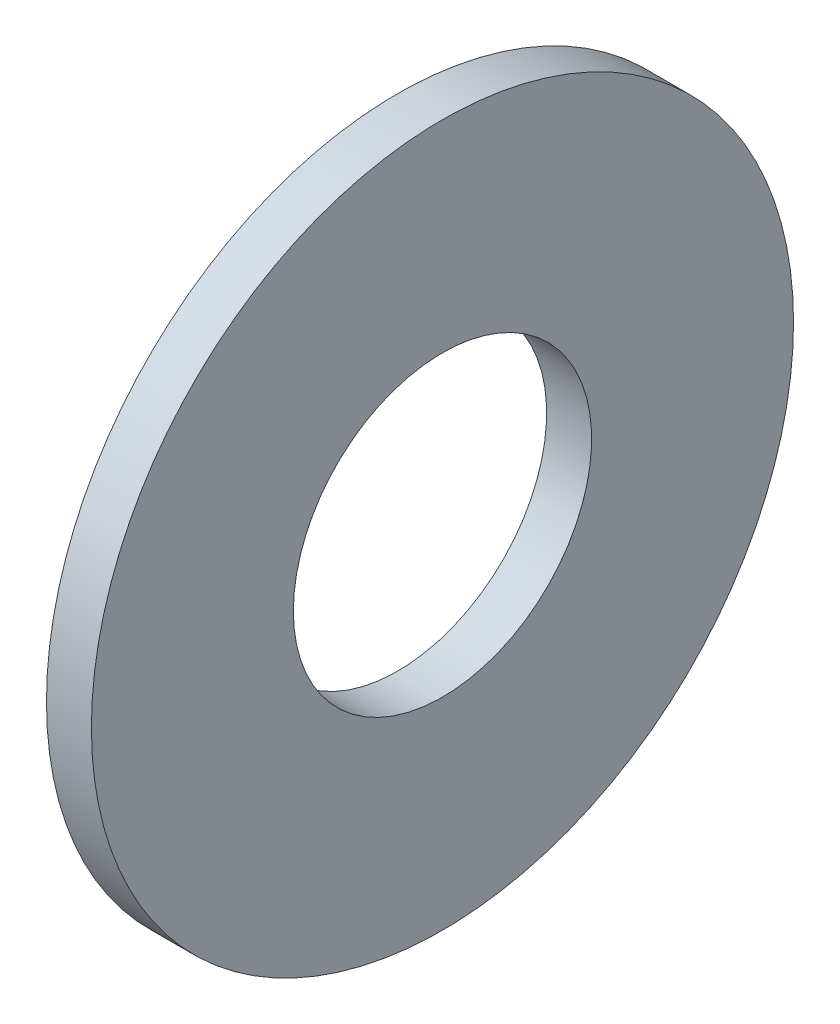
from build123d import *

# Parameters (mm, degrees)
SKETCH1_W = 4.064
SKETCH1_H = 18.2626


with BuildPart() as part:
    # Sketch1 → Base-Revolve (revolve)
    with BuildSketch(Plane.XY, mode=Mode.PRIVATE) as base_revolve_sk:
        with Locations((-2.032, 22.6187)):
            Rectangle(SKETCH1_W, SKETCH1_H)
    revolve(base_revolve_sk.sketch.rotate(Axis((-34.925, 0, 0), (1, 0, 0)), 90), axis=Axis((-34.925, 0, 0), (1, 0, 0)))


solid = part.part
